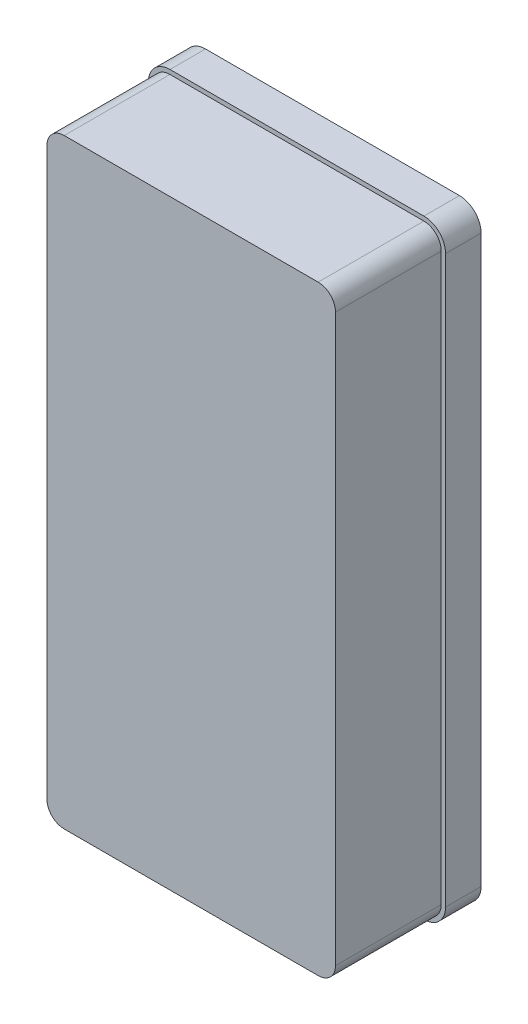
from build123d import *

# Parameters (mm, degrees)
EXTRUSION1_DEPTH = 4.1
EXTRUSION2_DEPTH = 12.2


with BuildPart() as part:
    # Esquisse1 → Extrusion1 (new body)
    with BuildSketch(Plane.XY):
        with BuildLine():
            Line((-14.65, 35.15), (14.65, 35.15))
            ThreePointArc((14.65, 35.15), (16.417766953, 34.417766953), (17.15, 32.65))
            Line((17.15, 32.65), (17.15, -32.65))
            ThreePointArc((17.15, -32.65), (16.417766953, -34.417766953), (14.65, -35.15))
            Line((14.65, -35.15), (-14.65, -35.15))
            ThreePointArc((-14.65, -35.15), (-16.417766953, -34.417766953), (-17.15, -32.65))
            Line((-17.15, -32.65), (-17.15, 32.65))
            ThreePointArc((-17.15, 32.65), (-16.417766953, 34.417766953), (-14.65, 35.15))
        make_face()
    extrude(amount=EXTRUSION1_DEPTH)

    # Esquisse2 → Extrusion2 (add)
    with BuildSketch(Plane.XY.offset(4.1)):
        with BuildLine():
            Line((-16.65, 32.65), (-16.65, -32.65))
            ThreePointArc((-16.65, -32.65), (-16.064213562, -34.064213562), (-14.65, -34.65))
            Line((-14.65, -34.65), (14.65, -34.65))
            ThreePointArc((14.65, -34.65), (16.064213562, -34.064213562), (16.65, -32.65))
            Line((16.65, -32.65), (16.65, 32.65))
            ThreePointArc((16.65, 32.65), (16.064213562, 34.064213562), (14.65, 34.65))
            Line((14.65, 34.65), (-14.65, 34.65))
            ThreePointArc((-14.65, 34.65), (-16.064213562, 34.064213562), (-16.65, 32.65))
        make_face()
    extrude(amount=EXTRUSION2_DEPTH)


solid = part.part
